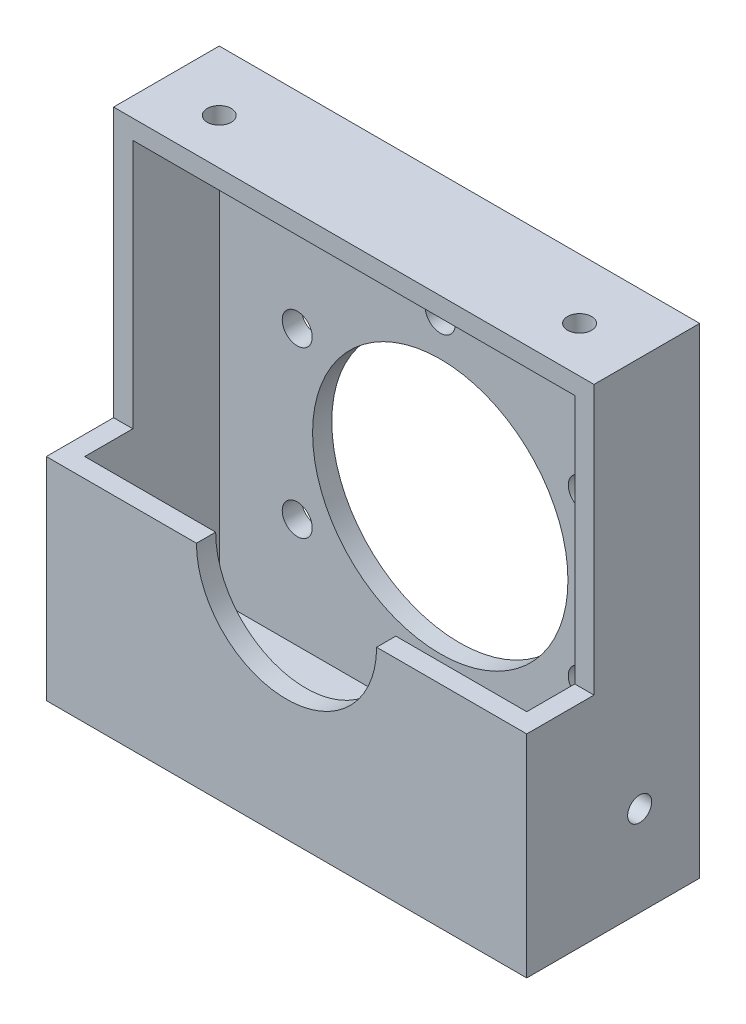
ISO-10303-21;
HEADER;
FILE_DESCRIPTION(('STEP AP214'),'2;1');
FILE_NAME('part.step','',(''),(''),'','','');
FILE_SCHEMA(('AUTOMOTIVE_DESIGN { 1 0 10303 214 1 1 1 1 }'));
ENDSEC;
DATA;
#1=APPLICATION_CONTEXT('core data for automotive mechanical design processes');
#2=APPLICATION_PROTOCOL_DEFINITION('international standard','automotive_design',2000,#1);
#3=PRODUCT_CONTEXT('',#1,'mechanical');
#4=PRODUCT('Part','Part','',(#3));
#5=PRODUCT_RELATED_PRODUCT_CATEGORY('part','',(#4));
#6=PRODUCT_DEFINITION_FORMATION('','',#4);
#7=PRODUCT_DEFINITION_CONTEXT('part definition',#1,'design');
#8=PRODUCT_DEFINITION('design','',#6,#7);
#9=PRODUCT_DEFINITION_SHAPE('','',#8);
#10=(LENGTH_UNIT() NAMED_UNIT(*) SI_UNIT(.MILLI.,.METRE.));
#11=(NAMED_UNIT(*) PLANE_ANGLE_UNIT() SI_UNIT($,.RADIAN.));
#12=(NAMED_UNIT(*) SI_UNIT($,.STERADIAN.) SOLID_ANGLE_UNIT());
#13=UNCERTAINTY_MEASURE_WITH_UNIT(LENGTH_MEASURE(1.E-05),#10,'distance_accuracy_value','');
#14=(GEOMETRIC_REPRESENTATION_CONTEXT(3) GLOBAL_UNCERTAINTY_ASSIGNED_CONTEXT((#13)) GLOBAL_UNIT_ASSIGNED_CONTEXT((#10,
#11,#12)) REPRESENTATION_CONTEXT('',''));
#15=CARTESIAN_POINT('',(0.,0.,0.));
#16=DIRECTION('',(0.,0.,1.));
#17=DIRECTION('',(1.,0.,0.));
#18=AXIS2_PLACEMENT_3D('',#15,#16,#17);
#19=CARTESIAN_POINT('',(0.,22.352,11.176));
#20=DIRECTION('',(0.,1.,0.));
#21=DIRECTION('',(0.,0.,1.));
#22=AXIS2_PLACEMENT_3D('',#19,#20,#21);
#23=PLANE('',#22);
#24=DIRECTION('',(0.,0.,1.));
#25=VECTOR('',#24,1.);
#26=CARTESIAN_POINT('',(15.875,22.352,0.));
#27=LINE('',#26,#25);
#28=CARTESIAN_POINT('',(15.875,22.352,16.256));
#29=VERTEX_POINT('',#28);
#30=CARTESIAN_POINT('',(15.875,22.352,18.288));
#31=VERTEX_POINT('',#30);
#32=EDGE_CURVE('E131',#29,#31,#27,.T.);
#33=ORIENTED_EDGE('',*,*,#32,.F.);
#34=DIRECTION('',(1.,0.,0.));
#35=VECTOR('',#34,1.);
#36=CARTESIAN_POINT('',(0.,22.352,16.256));
#37=LINE('',#36,#35);
#38=CARTESIAN_POINT('',(2.032,22.352,16.256));
#39=VERTEX_POINT('',#38);
#40=EDGE_CURVE('E251',#39,#29,#37,.T.);
#41=ORIENTED_EDGE('',*,*,#40,.F.);
#42=DIRECTION('',(0.,0.,1.));
#43=VECTOR('',#42,1.);
#44=CARTESIAN_POINT('',(2.032,22.352,11.176));
#45=LINE('',#44,#43);
#46=CARTESIAN_POINT('',(2.032,22.352,11.176));
#47=VERTEX_POINT('',#46);
#48=EDGE_CURVE('E256',#47,#39,#45,.T.);
#49=ORIENTED_EDGE('',*,*,#48,.F.);
#50=DIRECTION('',(1.,0.,0.));
#51=VECTOR('',#50,1.);
#52=CARTESIAN_POINT('',(0.,22.352,11.176));
#53=LINE('',#52,#51);
#54=CARTESIAN_POINT('',(0.,22.352,11.176));
#55=VERTEX_POINT('',#54);
#56=EDGE_CURVE('E159',#55,#47,#53,.T.);
#57=ORIENTED_EDGE('',*,*,#56,.F.);
#58=DIRECTION('',(0.,0.,1.));
#59=VECTOR('',#58,1.);
#60=CARTESIAN_POINT('',(0.,22.352,11.176));
#61=LINE('',#60,#59);
#62=CARTESIAN_POINT('',(0.,22.352,18.288));
#63=VERTEX_POINT('',#62);
#64=EDGE_CURVE('E155',#55,#63,#61,.T.);
#65=ORIENTED_EDGE('',*,*,#64,.T.);
#66=DIRECTION('',(1.,0.,0.));
#67=VECTOR('',#66,1.);
#68=CARTESIAN_POINT('',(0.,22.352,18.288));
#69=LINE('',#68,#67);
#70=EDGE_CURVE('E150',#63,#31,#69,.T.);
#71=ORIENTED_EDGE('',*,*,#70,.T.);
#72=EDGE_LOOP('',(#33,#41,#49,#57,#65,#71));
#73=FACE_BOUND('',#72,.T.);
#74=ADVANCED_FACE('F28',(#73),#23,.T.);
#75=CARTESIAN_POINT('',(50.8,50.8,18.288));
#76=DIRECTION('',(0.,-1.,0.));
#77=DIRECTION('',(1.,0.,0.));
#78=AXIS2_PLACEMENT_3D('',#75,#76,#77);
#79=PLANE('',#78);
#80=DIRECTION('',(0.,0.,-1.));
#81=VECTOR('',#80,1.);
#82=CARTESIAN_POINT('',(0.,50.8,18.288));
#83=LINE('',#82,#81);
#84=CARTESIAN_POINT('',(0.,50.8,11.176));
#85=VERTEX_POINT('',#84);
#86=CARTESIAN_POINT('',(0.,50.8,0.));
#87=VERTEX_POINT('',#86);
#88=EDGE_CURVE('E180',#85,#87,#83,.T.);
#89=ORIENTED_EDGE('',*,*,#88,.F.);
#90=DIRECTION('',(1.,0.,0.));
#91=VECTOR('',#90,1.);
#92=CARTESIAN_POINT('',(0.,50.8,11.176));
#93=LINE('',#92,#91);
#94=CARTESIAN_POINT('',(50.8,50.8,11.176));
#95=VERTEX_POINT('',#94);
#96=EDGE_CURVE('E165',#85,#95,#93,.T.);
#97=ORIENTED_EDGE('',*,*,#96,.T.);
#98=DIRECTION('',(0.,0.,-1.));
#99=VECTOR('',#98,1.);
#100=CARTESIAN_POINT('',(50.8,50.8,18.288));
#101=LINE('',#100,#99);
#102=CARTESIAN_POINT('',(50.8,50.8,0.));
#103=VERTEX_POINT('',#102);
#104=EDGE_CURVE('E184',#95,#103,#101,.T.);
#105=ORIENTED_EDGE('',*,*,#104,.T.);
#106=DIRECTION('',(-1.,0.,0.));
#107=VECTOR('',#106,1.);
#108=CARTESIAN_POINT('',(50.8,50.8,0.));
#109=LINE('',#108,#107);
#110=EDGE_CURVE('E164',#103,#87,#109,.T.);
#111=ORIENTED_EDGE('',*,*,#110,.T.);
#112=EDGE_LOOP('',(#89,#97,#105,#111));
#113=FACE_BOUND('',#112,.T.);
#114=CARTESIAN_POINT('',(44.45,50.8,6.34999999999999));
#115=DIRECTION('',(0.,1.,0.));
#116=DIRECTION('',(-1.,0.,0.));
#117=AXIS2_PLACEMENT_3D('',#114,#115,#116);
#118=CIRCLE('',#117,1.27);
#119=CARTESIAN_POINT('',(43.18,50.8,6.34999999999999));
#120=VERTEX_POINT('',#119);
#121=EDGE_CURVE('E211',#120,#120,#118,.T.);
#122=ORIENTED_EDGE('',*,*,#121,.F.);
#123=EDGE_LOOP('',(#122));
#124=FACE_BOUND('',#123,.T.);
#125=CARTESIAN_POINT('',(6.35,50.8,6.35));
#126=DIRECTION('',(0.,-1.,0.));
#127=DIRECTION('',(1.,0.,0.));
#128=AXIS2_PLACEMENT_3D('',#125,#126,#127);
#129=CIRCLE('',#128,1.27);
#130=CARTESIAN_POINT('',(5.08,50.8,6.35));
#131=VERTEX_POINT('',#130);
#132=EDGE_CURVE('E207',#131,#131,#129,.T.);
#133=ORIENTED_EDGE('',*,*,#132,.T.);
#134=EDGE_LOOP('',(#133));
#135=FACE_BOUND('',#134,.T.);
#136=ADVANCED_FACE('F281',(#113,#124,#135),#79,.F.);
#137=CARTESIAN_POINT('',(50.8,48.768,18.288));
#138=DIRECTION('',(0.,-1.,0.));
#139=DIRECTION('',(1.,0.,0.));
#140=AXIS2_PLACEMENT_3D('',#137,#138,#139);
#141=PLANE('',#140);
#142=DIRECTION('',(0.,0.,-1.));
#143=VECTOR('',#142,1.);
#144=CARTESIAN_POINT('',(2.032,48.768,18.288));
#145=LINE('',#144,#143);
#146=CARTESIAN_POINT('',(2.032,48.768,11.176));
#147=VERTEX_POINT('',#146);
#148=CARTESIAN_POINT('',(2.032,48.768,2.032));
#149=VERTEX_POINT('',#148);
#150=EDGE_CURVE('E229',#147,#149,#145,.T.);
#151=ORIENTED_EDGE('',*,*,#150,.T.);
#152=DIRECTION('',(-1.,0.,0.));
#153=VECTOR('',#152,1.);
#154=CARTESIAN_POINT('',(0.,48.768,2.032));
#155=LINE('',#154,#153);
#156=CARTESIAN_POINT('',(48.768,48.768,2.032));
#157=VERTEX_POINT('',#156);
#158=EDGE_CURVE('E236',#157,#149,#155,.T.);
#159=ORIENTED_EDGE('',*,*,#158,.F.);
#160=DIRECTION('',(0.,0.,-1.));
#161=VECTOR('',#160,1.);
#162=CARTESIAN_POINT('',(48.768,48.768,18.288));
#163=LINE('',#162,#161);
#164=CARTESIAN_POINT('',(48.768,48.768,11.176));
#165=VERTEX_POINT('',#164);
#166=EDGE_CURVE('E232',#165,#157,#163,.T.);
#167=ORIENTED_EDGE('',*,*,#166,.F.);
#168=DIRECTION('',(1.,0.,0.));
#169=VECTOR('',#168,1.);
#170=CARTESIAN_POINT('',(50.8,48.768,11.176));
#171=LINE('',#170,#169);
#172=EDGE_CURVE('E237',#147,#165,#171,.T.);
#173=ORIENTED_EDGE('',*,*,#172,.F.);
#174=EDGE_LOOP('',(#151,#159,#167,#173));
#175=FACE_BOUND('',#174,.T.);
#176=CARTESIAN_POINT('',(44.45,48.768,6.34999999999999));
#177=DIRECTION('',(0.,-1.,0.));
#178=DIRECTION('',(1.,0.,0.));
#179=AXIS2_PLACEMENT_3D('',#176,#177,#178);
#180=CIRCLE('',#179,1.27);
#181=CARTESIAN_POINT('',(43.18,48.768,6.34999999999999));
#182=VERTEX_POINT('',#181);
#183=EDGE_CURVE('E210',#182,#182,#180,.F.);
#184=ORIENTED_EDGE('',*,*,#183,.T.);
#185=EDGE_LOOP('',(#184));
#186=FACE_BOUND('',#185,.T.);
#187=CARTESIAN_POINT('',(6.35,48.768,6.35));
#188=DIRECTION('',(0.,-1.,0.));
#189=DIRECTION('',(1.,0.,0.));
#190=AXIS2_PLACEMENT_3D('',#187,#188,#189);
#191=CIRCLE('',#190,1.27);
#192=CARTESIAN_POINT('',(5.08,48.768,6.35));
#193=VERTEX_POINT('',#192);
#194=EDGE_CURVE('E193',#193,#193,#191,.T.);
#195=ORIENTED_EDGE('',*,*,#194,.F.);
#196=EDGE_LOOP('',(#195));
#197=FACE_BOUND('',#196,.T.);
#198=ADVANCED_FACE('F315',(#175,#186,#197),#141,.T.);
#199=CARTESIAN_POINT('',(0.,0.,0.));
#200=DIRECTION('',(0.,0.,-1.));
#201=DIRECTION('',(-1.,0.,0.));
#202=AXIS2_PLACEMENT_3D('',#199,#200,#201);
#203=PLANE('',#202);
#204=CARTESIAN_POINT('',(10.2770313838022,13.6207500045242,0.));
#205=DIRECTION('',(0.,0.,-1.));
#206=DIRECTION('',(-0.50000000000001,-0.866025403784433,0.));
#207=AXIS2_PLACEMENT_3D('',#204,#205,#206);
#208=CIRCLE('',#207,1.58750000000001);
#209=CARTESIAN_POINT('',(9.48328138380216,12.2459346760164,0.));
#210=VERTEX_POINT('',#209);
#211=EDGE_CURVE('E493',#210,#210,#208,.T.);
#212=ORIENTED_EDGE('',*,*,#211,.F.);
#213=EDGE_LOOP('',(#212));
#214=FACE_BOUND('',#213,.T.);
#215=CARTESIAN_POINT('',(25.3999999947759,4.8895,0.));
#216=DIRECTION('',(0.,0.,-1.));
#217=DIRECTION('',(0.499999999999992,-0.866025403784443,0.));
#218=AXIS2_PLACEMENT_3D('',#215,#216,#217);
#219=CIRCLE('',#218,1.58750000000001);
#220=CARTESIAN_POINT('',(26.1937499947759,3.51468467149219,0.));
#221=VERTEX_POINT('',#220);
#222=EDGE_CURVE('E497',#221,#221,#219,.T.);
#223=ORIENTED_EDGE('',*,*,#222,.F.);
#224=EDGE_LOOP('',(#223));
#225=FACE_BOUND('',#224,.T.);
#226=CARTESIAN_POINT('',(40.5229686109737,13.6207499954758,0.));
#227=DIRECTION('',(0.,0.,-1.));
#228=DIRECTION('',(1.,0.,0.));
#229=AXIS2_PLACEMENT_3D('',#226,#227,#228);
#230=CIRCLE('',#229,1.58750000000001);
#231=CARTESIAN_POINT('',(42.1104686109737,13.6207499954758,0.));
#232=VERTEX_POINT('',#231);
#233=EDGE_CURVE('E501',#232,#232,#230,.T.);
#234=ORIENTED_EDGE('',*,*,#233,.F.);
#235=EDGE_LOOP('',(#234));
#236=FACE_BOUND('',#235,.T.);
#237=CARTESIAN_POINT('',(40.5229686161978,31.0832499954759,0.));
#238=DIRECTION('',(0.,0.,-1.));
#239=DIRECTION('',(0.500000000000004,0.866025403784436,0.));
#240=AXIS2_PLACEMENT_3D('',#237,#238,#239);
#241=CIRCLE('',#240,1.58750000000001);
#242=CARTESIAN_POINT('',(41.3167186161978,32.4580653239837,0.));
#243=VERTEX_POINT('',#242);
#244=EDGE_CURVE('E505',#243,#243,#241,.T.);
#245=ORIENTED_EDGE('',*,*,#244,.F.);
#246=EDGE_LOOP('',(#245));
#247=FACE_BOUND('',#246,.T.);
#248=CARTESIAN_POINT('',(25.400000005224,39.8145,0.));
#249=DIRECTION('',(0.,0.,-1.));
#250=DIRECTION('',(-0.499999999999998,0.86602540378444,0.));
#251=AXIS2_PLACEMENT_3D('',#248,#249,#250);
#252=CIRCLE('',#251,1.58750000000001);
#253=CARTESIAN_POINT('',(24.606250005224,41.1893153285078,0.));
#254=VERTEX_POINT('',#253);
#255=EDGE_CURVE('E509',#254,#254,#252,.T.);
#256=ORIENTED_EDGE('',*,*,#255,.F.);
#257=EDGE_LOOP('',(#256));
#258=FACE_BOUND('',#257,.T.);
#259=CARTESIAN_POINT('',(10.2770313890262,31.0832500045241,0.));
#260=DIRECTION('',(0.,0.,-1.));
#261=DIRECTION('',(-1.,0.,0.));
#262=AXIS2_PLACEMENT_3D('',#259,#260,#261);
#263=CIRCLE('',#262,1.58750000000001);
#264=CARTESIAN_POINT('',(8.68953138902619,31.0832500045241,0.));
#265=VERTEX_POINT('',#264);
#266=EDGE_CURVE('E512',#265,#265,#263,.T.);
#267=ORIENTED_EDGE('',*,*,#266,.F.);
#268=EDGE_LOOP('',(#267));
#269=FACE_BOUND('',#268,.T.);
#270=DIRECTION('',(0.,1.,0.));
#271=VECTOR('',#270,1.);
#272=CARTESIAN_POINT('',(0.,0.,0.));
#273=LINE('',#272,#271);
#274=CARTESIAN_POINT('',(0.,0.,0.));
#275=VERTEX_POINT('',#274);
#276=EDGE_CURVE('E161',#275,#87,#273,.T.);
#277=ORIENTED_EDGE('',*,*,#276,.T.);
#278=ORIENTED_EDGE('',*,*,#110,.F.);
#279=DIRECTION('',(0.,-1.,0.));
#280=VECTOR('',#279,1.);
#281=CARTESIAN_POINT('',(50.8,50.8,0.));
#282=LINE('',#281,#280);
#283=CARTESIAN_POINT('',(50.8,0.,0.));
#284=VERTEX_POINT('',#283);
#285=EDGE_CURVE('E168',#103,#284,#282,.T.);
#286=ORIENTED_EDGE('',*,*,#285,.T.);
#287=DIRECTION('',(1.,0.,0.));
#288=VECTOR('',#287,1.);
#289=CARTESIAN_POINT('',(0.,0.,0.));
#290=LINE('',#289,#288);
#291=EDGE_CURVE('E171',#275,#284,#290,.T.);
#292=ORIENTED_EDGE('',*,*,#291,.F.);
#293=EDGE_LOOP('',(#277,#278,#286,#292));
#294=FACE_BOUND('',#293,.T.);
#295=CARTESIAN_POINT('',(25.4,22.352,0.));
#296=DIRECTION('',(0.,0.,1.));
#297=DIRECTION('',(1.,0.,0.));
#298=AXIS2_PLACEMENT_3D('',#295,#296,#297);
#299=CIRCLE('',#298,13.5001);
#300=CARTESIAN_POINT('',(38.9001,22.352,0.));
#301=VERTEX_POINT('',#300);
#302=EDGE_CURVE('E217',#301,#301,#299,.T.);
#303=ORIENTED_EDGE('',*,*,#302,.T.);
#304=EDGE_LOOP('',(#303));
#305=FACE_BOUND('',#304,.T.);
#306=ADVANCED_FACE('F284',(#214,#225,#236,#247,#258,#269,#294,#305),#203,.T.);
#307=CARTESIAN_POINT('',(0.,0.,2.032));
#308=DIRECTION('',(0.,0.,-1.));
#309=DIRECTION('',(-1.,0.,0.));
#310=AXIS2_PLACEMENT_3D('',#307,#308,#309);
#311=PLANE('',#310);
#312=CARTESIAN_POINT('',(10.2770313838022,13.6207500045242,2.032));
#313=DIRECTION('',(0.,0.,-1.));
#314=DIRECTION('',(-1.,0.,0.));
#315=AXIS2_PLACEMENT_3D('',#312,#313,#314);
#316=CIRCLE('',#315,1.58750000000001);
#317=CARTESIAN_POINT('',(8.68953138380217,13.6207500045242,2.032));
#318=VERTEX_POINT('',#317);
#319=EDGE_CURVE('E530',#318,#318,#316,.F.);
#320=ORIENTED_EDGE('',*,*,#319,.F.);
#321=EDGE_LOOP('',(#320));
#322=FACE_BOUND('',#321,.T.);
#323=CARTESIAN_POINT('',(25.3999999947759,4.8895,2.032));
#324=DIRECTION('',(0.,0.,-1.));
#325=DIRECTION('',(-1.,0.,0.));
#326=AXIS2_PLACEMENT_3D('',#323,#324,#325);
#327=CIRCLE('',#326,1.58750000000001);
#328=CARTESIAN_POINT('',(23.8124999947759,4.8895,2.032));
#329=VERTEX_POINT('',#328);
#330=EDGE_CURVE('E526',#329,#329,#327,.F.);
#331=ORIENTED_EDGE('',*,*,#330,.F.);
#332=EDGE_LOOP('',(#331));
#333=FACE_BOUND('',#332,.T.);
#334=CARTESIAN_POINT('',(40.5229686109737,13.6207499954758,2.032));
#335=DIRECTION('',(0.,0.,-1.));
#336=DIRECTION('',(-1.,0.,0.));
#337=AXIS2_PLACEMENT_3D('',#334,#335,#336);
#338=CIRCLE('',#337,1.58750000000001);
#339=CARTESIAN_POINT('',(38.9354686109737,13.6207499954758,2.032));
#340=VERTEX_POINT('',#339);
#341=EDGE_CURVE('E524',#340,#340,#338,.F.);
#342=ORIENTED_EDGE('',*,*,#341,.F.);
#343=EDGE_LOOP('',(#342));
#344=FACE_BOUND('',#343,.T.);
#345=CARTESIAN_POINT('',(40.5229686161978,31.0832499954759,2.032));
#346=DIRECTION('',(0.,0.,-1.));
#347=DIRECTION('',(-1.,0.,0.));
#348=AXIS2_PLACEMENT_3D('',#345,#346,#347);
#349=CIRCLE('',#348,1.58750000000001);
#350=CARTESIAN_POINT('',(38.9354686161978,31.0832499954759,2.032));
#351=VERTEX_POINT('',#350);
#352=EDGE_CURVE('E520',#351,#351,#349,.F.);
#353=ORIENTED_EDGE('',*,*,#352,.F.);
#354=EDGE_LOOP('',(#353));
#355=FACE_BOUND('',#354,.T.);
#356=CARTESIAN_POINT('',(25.400000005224,39.8145,2.032));
#357=DIRECTION('',(0.,0.,-1.));
#358=DIRECTION('',(-1.,0.,0.));
#359=AXIS2_PLACEMENT_3D('',#356,#357,#358);
#360=CIRCLE('',#359,1.58750000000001);
#361=CARTESIAN_POINT('',(23.812500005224,39.8145,2.032));
#362=VERTEX_POINT('',#361);
#363=EDGE_CURVE('E513',#362,#362,#360,.F.);
#364=ORIENTED_EDGE('',*,*,#363,.F.);
#365=EDGE_LOOP('',(#364));
#366=FACE_BOUND('',#365,.T.);
#367=CARTESIAN_POINT('',(10.2770313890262,31.0832500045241,2.032));
#368=DIRECTION('',(0.,0.,-1.));
#369=DIRECTION('',(-1.,0.,0.));
#370=AXIS2_PLACEMENT_3D('',#367,#368,#369);
#371=CIRCLE('',#370,1.58750000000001);
#372=CARTESIAN_POINT('',(8.68953138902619,31.0832500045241,2.032));
#373=VERTEX_POINT('',#372);
#374=EDGE_CURVE('E201',#373,#373,#371,.F.);
#375=ORIENTED_EDGE('',*,*,#374,.F.);
#376=EDGE_LOOP('',(#375));
#377=FACE_BOUND('',#376,.T.);
#378=DIRECTION('',(0.,1.,0.));
#379=VECTOR('',#378,1.);
#380=CARTESIAN_POINT('',(2.032,0.,2.032));
#381=LINE('',#380,#379);
#382=CARTESIAN_POINT('',(2.032,2.032,2.032));
#383=VERTEX_POINT('',#382);
#384=EDGE_CURVE('E233',#383,#149,#381,.T.);
#385=ORIENTED_EDGE('',*,*,#384,.F.);
#386=DIRECTION('',(1.,0.,0.));
#387=VECTOR('',#386,1.);
#388=CARTESIAN_POINT('',(0.,2.032,2.032));
#389=LINE('',#388,#387);
#390=CARTESIAN_POINT('',(48.768,2.03200000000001,2.032));
#391=VERTEX_POINT('',#390);
#392=EDGE_CURVE('E225',#383,#391,#389,.T.);
#393=ORIENTED_EDGE('',*,*,#392,.T.);
#394=DIRECTION('',(0.,-1.,0.));
#395=VECTOR('',#394,1.);
#396=CARTESIAN_POINT('',(48.768,0.,2.032));
#397=LINE('',#396,#395);
#398=EDGE_CURVE('E244',#157,#391,#397,.T.);
#399=ORIENTED_EDGE('',*,*,#398,.F.);
#400=ORIENTED_EDGE('',*,*,#158,.T.);
#401=EDGE_LOOP('',(#385,#393,#399,#400));
#402=FACE_BOUND('',#401,.T.);
#403=CARTESIAN_POINT('',(25.4,22.352,2.032));
#404=DIRECTION('',(0.,0.,-1.));
#405=DIRECTION('',(-1.,0.,0.));
#406=AXIS2_PLACEMENT_3D('',#403,#404,#405);
#407=CIRCLE('',#406,13.5001);
#408=CARTESIAN_POINT('',(11.8999,22.352,2.032));
#409=VERTEX_POINT('',#408);
#410=EDGE_CURVE('E214',#409,#409,#407,.T.);
#411=ORIENTED_EDGE('',*,*,#410,.T.);
#412=EDGE_LOOP('',(#411));
#413=FACE_BOUND('',#412,.T.);
#414=ADVANCED_FACE('F321',(#322,#333,#344,#355,#366,#377,#402,#413),#311,.F.);
#415=CARTESIAN_POINT('',(0.,22.352,11.176));
#416=DIRECTION('',(0.,0.,-1.));
#417=DIRECTION('',(-1.,0.,0.));
#418=AXIS2_PLACEMENT_3D('',#415,#416,#417);
#419=PLANE('',#418);
#420=DIRECTION('',(0.,1.,0.));
#421=VECTOR('',#420,1.);
#422=CARTESIAN_POINT('',(48.768,50.8,11.176));
#423=LINE('',#422,#421);
#424=CARTESIAN_POINT('',(48.768,22.352,11.176));
#425=VERTEX_POINT('',#424);
#426=EDGE_CURVE('E254',#425,#165,#423,.T.);
#427=ORIENTED_EDGE('',*,*,#426,.F.);
#428=CARTESIAN_POINT('',(50.8,22.352,11.176));
#429=VERTEX_POINT('',#428);
#430=EDGE_CURVE('E153',#425,#429,#53,.T.);
#431=ORIENTED_EDGE('',*,*,#430,.T.);
#432=DIRECTION('',(0.,1.,0.));
#433=VECTOR('',#432,1.);
#434=CARTESIAN_POINT('',(50.8,22.352,11.176));
#435=LINE('',#434,#433);
#436=EDGE_CURVE('E264',#429,#95,#435,.T.);
#437=ORIENTED_EDGE('',*,*,#436,.T.);
#438=ORIENTED_EDGE('',*,*,#96,.F.);
#439=DIRECTION('',(0.,1.,0.));
#440=VECTOR('',#439,1.);
#441=CARTESIAN_POINT('',(0.,22.352,11.176));
#442=LINE('',#441,#440);
#443=EDGE_CURVE('E151',#55,#85,#442,.T.);
#444=ORIENTED_EDGE('',*,*,#443,.F.);
#445=ORIENTED_EDGE('',*,*,#56,.T.);
#446=DIRECTION('',(0.,1.,0.));
#447=VECTOR('',#446,1.);
#448=CARTESIAN_POINT('',(2.032,22.352,11.176));
#449=LINE('',#448,#447);
#450=EDGE_CURVE('E259',#47,#147,#449,.T.);
#451=ORIENTED_EDGE('',*,*,#450,.T.);
#452=ORIENTED_EDGE('',*,*,#172,.T.);
#453=EDGE_LOOP('',(#427,#431,#437,#438,#444,#445,#451,#452));
#454=FACE_BOUND('',#453,.T.);
#455=ADVANCED_FACE('F275',(#454),#419,.F.);
#456=DIRECTION('',(0.,0.,1.));
#457=VECTOR('',#456,1.);
#458=CARTESIAN_POINT('',(34.925,22.352,0.));
#459=LINE('',#458,#457);
#460=CARTESIAN_POINT('',(34.925,22.352,18.288));
#461=VERTEX_POINT('',#460);
#462=CARTESIAN_POINT('',(34.925,22.352,16.256));
#463=VERTEX_POINT('',#462);
#464=EDGE_CURVE('E42',#461,#463,#459,.F.);
#465=ORIENTED_EDGE('',*,*,#464,.F.);
#466=CARTESIAN_POINT('',(50.8,22.352,18.288));
#467=VERTEX_POINT('',#466);
#468=EDGE_CURVE('E141',#461,#467,#69,.T.);
#469=ORIENTED_EDGE('',*,*,#468,.T.);
#470=DIRECTION('',(0.,0.,1.));
#471=VECTOR('',#470,1.);
#472=CARTESIAN_POINT('',(50.8,22.352,11.176));
#473=LINE('',#472,#471);
#474=EDGE_CURVE('E240',#429,#467,#473,.T.);
#475=ORIENTED_EDGE('',*,*,#474,.F.);
#476=ORIENTED_EDGE('',*,*,#430,.F.);
#477=DIRECTION('',(0.,0.,1.));
#478=VECTOR('',#477,1.);
#479=CARTESIAN_POINT('',(48.768,22.352,18.288));
#480=LINE('',#479,#478);
#481=CARTESIAN_POINT('',(48.768,22.352,16.256));
#482=VERTEX_POINT('',#481);
#483=EDGE_CURVE('E220',#425,#482,#480,.T.);
#484=ORIENTED_EDGE('',*,*,#483,.T.);
#485=EDGE_CURVE('E144',#463,#482,#37,.T.);
#486=ORIENTED_EDGE('',*,*,#485,.F.);
#487=EDGE_LOOP('',(#465,#469,#475,#476,#484,#486));
#488=FACE_BOUND('',#487,.T.);
#489=ADVANCED_FACE('F139',(#488),#23,.T.);
#490=CARTESIAN_POINT('',(0.,0.,18.288));
#491=DIRECTION('',(0.,0.,-1.));
#492=DIRECTION('',(-1.,0.,0.));
#493=AXIS2_PLACEMENT_3D('',#490,#491,#492);
#494=PLANE('',#493);
#495=ORIENTED_EDGE('',*,*,#468,.F.);
#496=CARTESIAN_POINT('',(25.4,22.352,18.288));
#497=DIRECTION('',(0.,0.,1.));
#498=DIRECTION('',(1.,0.,0.));
#499=AXIS2_PLACEMENT_3D('',#496,#497,#498);
#500=CIRCLE('',#499,9.525);
#501=EDGE_CURVE('E128',#31,#461,#500,.T.);
#502=ORIENTED_EDGE('',*,*,#501,.F.);
#503=ORIENTED_EDGE('',*,*,#70,.F.);
#504=DIRECTION('',(0.,1.,0.));
#505=VECTOR('',#504,1.);
#506=CARTESIAN_POINT('',(0.,0.,18.288));
#507=LINE('',#506,#505);
#508=CARTESIAN_POINT('',(0.,0.,18.288));
#509=VERTEX_POINT('',#508);
#510=EDGE_CURVE('E174',#509,#63,#507,.T.);
#511=ORIENTED_EDGE('',*,*,#510,.F.);
#512=DIRECTION('',(1.,0.,0.));
#513=VECTOR('',#512,1.);
#514=CARTESIAN_POINT('',(0.,0.,18.288));
#515=LINE('',#514,#513);
#516=CARTESIAN_POINT('',(50.8,0.,18.288));
#517=VERTEX_POINT('',#516);
#518=EDGE_CURVE('E178',#509,#517,#515,.T.);
#519=ORIENTED_EDGE('',*,*,#518,.T.);
#520=DIRECTION('',(0.,-1.,0.));
#521=VECTOR('',#520,1.);
#522=CARTESIAN_POINT('',(50.8,50.8,18.288));
#523=LINE('',#522,#521);
#524=EDGE_CURVE('E149',#467,#517,#523,.T.);
#525=ORIENTED_EDGE('',*,*,#524,.F.);
#526=EDGE_LOOP('',(#495,#502,#503,#511,#519,#525));
#527=FACE_BOUND('',#526,.T.);
#528=ADVANCED_FACE('F147',(#527),#494,.F.);
#529=CARTESIAN_POINT('',(0.,0.,18.288));
#530=DIRECTION('',(-1.,0.,0.));
#531=DIRECTION('',(0.,0.,1.));
#532=AXIS2_PLACEMENT_3D('',#529,#530,#531);
#533=PLANE('',#532);
#534=CARTESIAN_POINT('',(0.,9.525,6.34999999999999));
#535=DIRECTION('',(1.,0.,0.));
#536=DIRECTION('',(0.,1.,0.));
#537=AXIS2_PLACEMENT_3D('',#534,#535,#536);
#538=CIRCLE('',#537,1.27);
#539=CARTESIAN_POINT('',(0.,10.795,6.34999999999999));
#540=VERTEX_POINT('',#539);
#541=EDGE_CURVE('E189',#540,#540,#538,.T.);
#542=ORIENTED_EDGE('',*,*,#541,.T.);
#543=EDGE_LOOP('',(#542));
#544=FACE_BOUND('',#543,.T.);
#545=ORIENTED_EDGE('',*,*,#443,.T.);
#546=ORIENTED_EDGE('',*,*,#88,.T.);
#547=ORIENTED_EDGE('',*,*,#276,.F.);
#548=DIRECTION('',(0.,0.,-1.));
#549=VECTOR('',#548,1.);
#550=CARTESIAN_POINT('',(0.,0.,18.288));
#551=LINE('',#550,#549);
#552=EDGE_CURVE('E36',#509,#275,#551,.T.);
#553=ORIENTED_EDGE('',*,*,#552,.F.);
#554=ORIENTED_EDGE('',*,*,#510,.T.);
#555=ORIENTED_EDGE('',*,*,#64,.F.);
#556=EDGE_LOOP('',(#545,#546,#547,#553,#554,#555));
#557=FACE_BOUND('',#556,.T.);
#558=ADVANCED_FACE('F30',(#544,#557),#533,.T.);
#559=CARTESIAN_POINT('',(0.,0.,18.288));
#560=DIRECTION('',(0.,1.,0.));
#561=DIRECTION('',(-1.,0.,0.));
#562=AXIS2_PLACEMENT_3D('',#559,#560,#561);
#563=PLANE('',#562);
#564=ORIENTED_EDGE('',*,*,#291,.T.);
#565=DIRECTION('',(0.,0.,-1.));
#566=VECTOR('',#565,1.);
#567=CARTESIAN_POINT('',(50.8,0.,18.288));
#568=LINE('',#567,#566);
#569=EDGE_CURVE('E182',#517,#284,#568,.T.);
#570=ORIENTED_EDGE('',*,*,#569,.F.);
#571=ORIENTED_EDGE('',*,*,#518,.F.);
#572=ORIENTED_EDGE('',*,*,#552,.T.);
#573=EDGE_LOOP('',(#564,#570,#571,#572));
#574=FACE_BOUND('',#573,.T.);
#575=ADVANCED_FACE('F296',(#574),#563,.F.);
#576=CARTESIAN_POINT('',(50.8,50.8,18.288));
#577=DIRECTION('',(1.,0.,0.));
#578=DIRECTION('',(0.,1.,0.));
#579=AXIS2_PLACEMENT_3D('',#576,#577,#578);
#580=PLANE('',#579);
#581=CARTESIAN_POINT('',(50.8,9.525,6.34999999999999));
#582=DIRECTION('',(1.,0.,0.));
#583=DIRECTION('',(0.,1.,0.));
#584=AXIS2_PLACEMENT_3D('',#581,#582,#583);
#585=CIRCLE('',#584,1.27);
#586=CARTESIAN_POINT('',(50.8,10.795,6.34999999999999));
#587=VERTEX_POINT('',#586);
#588=EDGE_CURVE('E196',#587,#587,#585,.T.);
#589=ORIENTED_EDGE('',*,*,#588,.F.);
#590=EDGE_LOOP('',(#589));
#591=FACE_BOUND('',#590,.T.);
#592=ORIENTED_EDGE('',*,*,#436,.F.);
#593=ORIENTED_EDGE('',*,*,#474,.T.);
#594=ORIENTED_EDGE('',*,*,#524,.T.);
#595=ORIENTED_EDGE('',*,*,#569,.T.);
#596=ORIENTED_EDGE('',*,*,#285,.F.);
#597=ORIENTED_EDGE('',*,*,#104,.F.);
#598=EDGE_LOOP('',(#592,#593,#594,#595,#596,#597));
#599=FACE_BOUND('',#598,.T.);
#600=ADVANCED_FACE('F278',(#591,#599),#580,.T.);
#601=CARTESIAN_POINT('',(0.,0.,16.256));
#602=DIRECTION('',(0.,0.,-1.));
#603=DIRECTION('',(-1.,0.,0.));
#604=AXIS2_PLACEMENT_3D('',#601,#602,#603);
#605=PLANE('',#604);
#606=CARTESIAN_POINT('',(25.4,22.352,16.256));
#607=DIRECTION('',(0.,0.,-1.));
#608=DIRECTION('',(-1.,0.,0.));
#609=AXIS2_PLACEMENT_3D('',#606,#607,#608);
#610=CIRCLE('',#609,9.525);
#611=EDGE_CURVE('E11',#463,#29,#610,.T.);
#612=ORIENTED_EDGE('',*,*,#611,.F.);
#613=ORIENTED_EDGE('',*,*,#485,.T.);
#614=DIRECTION('',(0.,-1.,0.));
#615=VECTOR('',#614,1.);
#616=CARTESIAN_POINT('',(48.768,0.,16.256));
#617=LINE('',#616,#615);
#618=CARTESIAN_POINT('',(48.768,2.03200000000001,16.256));
#619=VERTEX_POINT('',#618);
#620=EDGE_CURVE('E224',#482,#619,#617,.T.);
#621=ORIENTED_EDGE('',*,*,#620,.T.);
#622=DIRECTION('',(1.,0.,0.));
#623=VECTOR('',#622,1.);
#624=CARTESIAN_POINT('',(0.,2.032,16.256));
#625=LINE('',#624,#623);
#626=CARTESIAN_POINT('',(2.032,2.032,16.256));
#627=VERTEX_POINT('',#626);
#628=EDGE_CURVE('E226',#627,#619,#625,.T.);
#629=ORIENTED_EDGE('',*,*,#628,.F.);
#630=DIRECTION('',(0.,1.,0.));
#631=VECTOR('',#630,1.);
#632=CARTESIAN_POINT('',(2.032,0.,16.256));
#633=LINE('',#632,#631);
#634=EDGE_CURVE('E50',#627,#39,#633,.T.);
#635=ORIENTED_EDGE('',*,*,#634,.T.);
#636=ORIENTED_EDGE('',*,*,#40,.T.);
#637=EDGE_LOOP('',(#612,#613,#621,#629,#635,#636));
#638=FACE_BOUND('',#637,.T.);
#639=ADVANCED_FACE('F303',(#638),#605,.T.);
#640=CARTESIAN_POINT('',(2.032,0.,18.288));
#641=DIRECTION('',(-1.,0.,0.));
#642=DIRECTION('',(0.,0.,1.));
#643=AXIS2_PLACEMENT_3D('',#640,#641,#642);
#644=PLANE('',#643);
#645=CARTESIAN_POINT('',(2.032,9.525,6.34999999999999));
#646=DIRECTION('',(-1.,0.,0.));
#647=DIRECTION('',(0.,0.,1.));
#648=AXIS2_PLACEMENT_3D('',#645,#646,#647);
#649=CIRCLE('',#648,1.27);
#650=CARTESIAN_POINT('',(2.032,9.525,7.61999999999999));
#651=VERTEX_POINT('',#650);
#652=EDGE_CURVE('E188',#651,#651,#649,.T.);
#653=ORIENTED_EDGE('',*,*,#652,.T.);
#654=EDGE_LOOP('',(#653));
#655=FACE_BOUND('',#654,.T.);
#656=ORIENTED_EDGE('',*,*,#450,.F.);
#657=ORIENTED_EDGE('',*,*,#48,.T.);
#658=ORIENTED_EDGE('',*,*,#634,.F.);
#659=DIRECTION('',(0.,0.,-1.));
#660=VECTOR('',#659,1.);
#661=CARTESIAN_POINT('',(2.032,2.032,18.288));
#662=LINE('',#661,#660);
#663=EDGE_CURVE('E238',#627,#383,#662,.T.);
#664=ORIENTED_EDGE('',*,*,#663,.T.);
#665=ORIENTED_EDGE('',*,*,#384,.T.);
#666=ORIENTED_EDGE('',*,*,#150,.F.);
#667=EDGE_LOOP('',(#656,#657,#658,#664,#665,#666));
#668=FACE_BOUND('',#667,.T.);
#669=ADVANCED_FACE('F338',(#655,#668),#644,.F.);
#670=CARTESIAN_POINT('',(0.,2.032,18.288));
#671=DIRECTION('',(0.,1.,0.));
#672=DIRECTION('',(-1.,0.,0.));
#673=AXIS2_PLACEMENT_3D('',#670,#671,#672);
#674=PLANE('',#673);
#675=ORIENTED_EDGE('',*,*,#392,.F.);
#676=ORIENTED_EDGE('',*,*,#663,.F.);
#677=ORIENTED_EDGE('',*,*,#628,.T.);
#678=DIRECTION('',(0.,0.,-1.));
#679=VECTOR('',#678,1.);
#680=CARTESIAN_POINT('',(48.768,2.03200000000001,18.288));
#681=LINE('',#680,#679);
#682=EDGE_CURVE('E241',#619,#391,#681,.T.);
#683=ORIENTED_EDGE('',*,*,#682,.T.);
#684=EDGE_LOOP('',(#675,#676,#677,#683));
#685=FACE_BOUND('',#684,.T.);
#686=ADVANCED_FACE('F336',(#685),#674,.T.);
#687=CARTESIAN_POINT('',(48.768,50.8,18.288));
#688=DIRECTION('',(1.,0.,0.));
#689=DIRECTION('',(0.,1.,0.));
#690=AXIS2_PLACEMENT_3D('',#687,#688,#689);
#691=PLANE('',#690);
#692=CARTESIAN_POINT('',(48.768,9.525,6.34999999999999));
#693=DIRECTION('',(1.,0.,0.));
#694=DIRECTION('',(0.,1.,0.));
#695=AXIS2_PLACEMENT_3D('',#692,#693,#694);
#696=CIRCLE('',#695,1.27);
#697=CARTESIAN_POINT('',(48.768,10.795,6.34999999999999));
#698=VERTEX_POINT('',#697);
#699=EDGE_CURVE('E186',#698,#698,#696,.T.);
#700=ORIENTED_EDGE('',*,*,#699,.T.);
#701=EDGE_LOOP('',(#700));
#702=FACE_BOUND('',#701,.T.);
#703=ORIENTED_EDGE('',*,*,#426,.T.);
#704=ORIENTED_EDGE('',*,*,#166,.T.);
#705=ORIENTED_EDGE('',*,*,#398,.T.);
#706=ORIENTED_EDGE('',*,*,#682,.F.);
#707=ORIENTED_EDGE('',*,*,#620,.F.);
#708=ORIENTED_EDGE('',*,*,#483,.F.);
#709=EDGE_LOOP('',(#703,#704,#705,#706,#707,#708));
#710=FACE_BOUND('',#709,.T.);
#711=ADVANCED_FACE('F332',(#702,#710),#691,.F.);
#712=CARTESIAN_POINT('',(25.4,22.352,18.289));
#713=DIRECTION('',(0.,0.,-1.));
#714=DIRECTION('',(-1.,0.,0.));
#715=AXIS2_PLACEMENT_3D('',#712,#713,#714);
#716=CYLINDRICAL_SURFACE('',#715,13.5001);
#717=ORIENTED_EDGE('',*,*,#302,.F.);
#718=EDGE_LOOP('',(#717));
#719=FACE_BOUND('',#718,.T.);
#720=ORIENTED_EDGE('',*,*,#410,.F.);
#721=EDGE_LOOP('',(#720));
#722=FACE_BOUND('',#721,.T.);
#723=ADVANCED_FACE('F335',(#719,#722),#716,.F.);
#724=CARTESIAN_POINT('',(44.45,-0.00100000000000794,6.34999999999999));
#725=DIRECTION('',(0.,1.,0.));
#726=DIRECTION('',(-1.,0.,0.));
#727=AXIS2_PLACEMENT_3D('',#724,#725,#726);
#728=CYLINDRICAL_SURFACE('',#727,1.27);
#729=CARTESIAN_POINT('',(43.18,48.768,6.34999999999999));
#730=CARTESIAN_POINT('',(43.18,48.7891666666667,6.34999999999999));
#731=CARTESIAN_POINT('',(43.18,48.8103333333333,6.34999999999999));
#732=CARTESIAN_POINT('',(43.18,48.8526666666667,6.34999999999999));
#733=CARTESIAN_POINT('',(43.18,48.8738333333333,6.34999999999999));
#734=CARTESIAN_POINT('',(43.18,48.9161666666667,6.34999999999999));
#735=CARTESIAN_POINT('',(43.18,48.9373333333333,6.34999999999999));
#736=CARTESIAN_POINT('',(43.18,48.9796666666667,6.34999999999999));
#737=CARTESIAN_POINT('',(43.18,49.0008333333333,6.34999999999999));
#738=CARTESIAN_POINT('',(43.18,49.0431666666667,6.34999999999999));
#739=CARTESIAN_POINT('',(43.18,49.0643333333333,6.34999999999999));
#740=CARTESIAN_POINT('',(43.18,49.1066666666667,6.34999999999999));
#741=CARTESIAN_POINT('',(43.18,49.1278333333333,6.34999999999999));
#742=CARTESIAN_POINT('',(43.18,49.1701666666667,6.34999999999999));
#743=CARTESIAN_POINT('',(43.18,49.1913333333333,6.34999999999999));
#744=CARTESIAN_POINT('',(43.18,49.2336666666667,6.34999999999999));
#745=CARTESIAN_POINT('',(43.18,49.2548333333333,6.34999999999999));
#746=CARTESIAN_POINT('',(43.18,49.2971666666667,6.34999999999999));
#747=CARTESIAN_POINT('',(43.18,49.3183333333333,6.34999999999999));
#748=CARTESIAN_POINT('',(43.18,49.3606666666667,6.34999999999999));
#749=CARTESIAN_POINT('',(43.18,49.3818333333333,6.34999999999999));
#750=CARTESIAN_POINT('',(43.18,49.4241666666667,6.34999999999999));
#751=CARTESIAN_POINT('',(43.18,49.4453333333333,6.34999999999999));
#752=CARTESIAN_POINT('',(43.18,49.4876666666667,6.34999999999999));
#753=CARTESIAN_POINT('',(43.18,49.5088333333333,6.34999999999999));
#754=CARTESIAN_POINT('',(43.18,49.5511666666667,6.34999999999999));
#755=CARTESIAN_POINT('',(43.18,49.5723333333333,6.34999999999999));
#756=CARTESIAN_POINT('',(43.18,49.6146666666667,6.34999999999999));
#757=CARTESIAN_POINT('',(43.18,49.6358333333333,6.34999999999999));
#758=CARTESIAN_POINT('',(43.18,49.6781666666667,6.34999999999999));
#759=CARTESIAN_POINT('',(43.18,49.6993333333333,6.34999999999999));
#760=CARTESIAN_POINT('',(43.18,49.7416666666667,6.34999999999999));
#761=CARTESIAN_POINT('',(43.18,49.7628333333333,6.34999999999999));
#762=CARTESIAN_POINT('',(43.18,49.8051666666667,6.34999999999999));
#763=CARTESIAN_POINT('',(43.18,49.8263333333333,6.34999999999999));
#764=CARTESIAN_POINT('',(43.18,49.8686666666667,6.34999999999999));
#765=CARTESIAN_POINT('',(43.18,49.8898333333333,6.34999999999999));
#766=CARTESIAN_POINT('',(43.18,49.9321666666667,6.34999999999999));
#767=CARTESIAN_POINT('',(43.18,49.9533333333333,6.34999999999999));
#768=CARTESIAN_POINT('',(43.18,49.9956666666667,6.34999999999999));
#769=CARTESIAN_POINT('',(43.18,50.0168333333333,6.34999999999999));
#770=CARTESIAN_POINT('',(43.18,50.0591666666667,6.34999999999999));
#771=CARTESIAN_POINT('',(43.18,50.0803333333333,6.34999999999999));
#772=CARTESIAN_POINT('',(43.18,50.1226666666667,6.34999999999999));
#773=CARTESIAN_POINT('',(43.18,50.1438333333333,6.34999999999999));
#774=CARTESIAN_POINT('',(43.18,50.1861666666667,6.34999999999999));
#775=CARTESIAN_POINT('',(43.18,50.2073333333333,6.34999999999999));
#776=CARTESIAN_POINT('',(43.18,50.2496666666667,6.34999999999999));
#777=CARTESIAN_POINT('',(43.18,50.2708333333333,6.34999999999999));
#778=CARTESIAN_POINT('',(43.18,50.3131666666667,6.34999999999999));
#779=CARTESIAN_POINT('',(43.18,50.3343333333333,6.34999999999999));
#780=CARTESIAN_POINT('',(43.18,50.3766666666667,6.34999999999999));
#781=CARTESIAN_POINT('',(43.18,50.3978333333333,6.34999999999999));
#782=CARTESIAN_POINT('',(43.18,50.4401666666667,6.34999999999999));
#783=CARTESIAN_POINT('',(43.18,50.4613333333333,6.34999999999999));
#784=CARTESIAN_POINT('',(43.18,50.5036666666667,6.34999999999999));
#785=CARTESIAN_POINT('',(43.18,50.5248333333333,6.34999999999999));
#786=CARTESIAN_POINT('',(43.18,50.5671666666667,6.34999999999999));
#787=CARTESIAN_POINT('',(43.18,50.5883333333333,6.34999999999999));
#788=CARTESIAN_POINT('',(43.18,50.6306666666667,6.34999999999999));
#789=CARTESIAN_POINT('',(43.18,50.6518333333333,6.34999999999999));
#790=CARTESIAN_POINT('',(43.18,50.6941666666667,6.34999999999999));
#791=CARTESIAN_POINT('',(43.18,50.7153333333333,6.34999999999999));
#792=CARTESIAN_POINT('',(43.18,50.7576666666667,6.34999999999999));
#793=CARTESIAN_POINT('',(43.18,50.7788333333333,6.34999999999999));
#794=CARTESIAN_POINT('',(43.18,50.8,6.34999999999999));
#795=B_SPLINE_CURVE_WITH_KNOTS('',3,(#729,#730,#731,#732,#733,#734,#735,#736,#737,#738,#739,
#740,#741,#742,#743,#744,#745,#746,#747,#748,#749,#750,#751,#752,#753,#754,#755,#756,#757,#758,
#759,#760,#761,#762,#763,#764,#765,#766,#767,#768,#769,#770,#771,#772,#773,#774,#775,#776,#777,
#778,#779,#780,#781,#782,#783,#784,#785,#786,#787,#788,#789,#790,#791,#792,#793,#794),
.UNSPECIFIED.,.F.,.F.,(4,2,2,2,2,2,2,2,2,2,2,2,2,2,2,2,2,2,2,2,2,2,2,2,2,2,2,2,2,2,2,2,4),(0.,
0.0635000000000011,0.127000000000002,0.190500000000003,0.254000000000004,0.317499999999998,
0.380999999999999,0.4445,0.508000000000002,0.571500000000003,0.635000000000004,
0.698500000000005,0.761999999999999,0.8255,0.889000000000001,0.952500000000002,1.016,1.0795,
1.14300000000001,1.20650000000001,1.27000000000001,1.3335,1.397,1.4605,1.524,1.58750000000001,
1.65100000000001,1.71450000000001,1.778,1.8415,1.905,1.96850000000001,2.03200000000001),.UNSPECIFIED.);
#796=EDGE_CURVE('BSEAM347',#182,#120,#795,.T.);
#797=ORIENTED_EDGE('',*,*,#183,.F.);
#798=ORIENTED_EDGE('',*,*,#121,.T.);
#799=ORIENTED_EDGE('',*,*,#796,.T.);
#800=ORIENTED_EDGE('',*,*,#796,.F.);
#801=EDGE_LOOP('',(#797,#799,#798,#800));
#802=FACE_BOUND('',#801,.T.);
#803=ADVANCED_FACE('F347',(#802),#728,.F.);
#804=CARTESIAN_POINT('',(6.34999999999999,-0.001000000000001,6.35));
#805=DIRECTION('',(0.,1.,0.));
#806=DIRECTION('',(-1.,0.,0.));
#807=AXIS2_PLACEMENT_3D('',#804,#805,#806);
#808=CYLINDRICAL_SURFACE('',#807,1.27);
#809=CARTESIAN_POINT('',(5.08,48.768,6.35));
#810=CARTESIAN_POINT('',(5.08,48.7891666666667,6.35));
#811=CARTESIAN_POINT('',(5.08,48.8103333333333,6.35));
#812=CARTESIAN_POINT('',(5.08,48.8526666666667,6.35));
#813=CARTESIAN_POINT('',(5.08,48.8738333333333,6.35));
#814=CARTESIAN_POINT('',(5.08,48.9161666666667,6.35));
#815=CARTESIAN_POINT('',(5.08,48.9373333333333,6.35));
#816=CARTESIAN_POINT('',(5.08,48.9796666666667,6.35));
#817=CARTESIAN_POINT('',(5.08,49.0008333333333,6.35));
#818=CARTESIAN_POINT('',(5.08,49.0431666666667,6.35));
#819=CARTESIAN_POINT('',(5.08,49.0643333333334,6.35));
#820=CARTESIAN_POINT('',(5.08,49.1066666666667,6.35));
#821=CARTESIAN_POINT('',(5.08,49.1278333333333,6.35));
#822=CARTESIAN_POINT('',(5.08,49.1701666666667,6.35));
#823=CARTESIAN_POINT('',(5.08,49.1913333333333,6.35));
#824=CARTESIAN_POINT('',(5.08,49.2336666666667,6.35));
#825=CARTESIAN_POINT('',(5.08,49.2548333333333,6.35));
#826=CARTESIAN_POINT('',(5.08,49.2971666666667,6.35));
#827=CARTESIAN_POINT('',(5.08,49.3183333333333,6.35));
#828=CARTESIAN_POINT('',(5.08,49.3606666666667,6.35));
#829=CARTESIAN_POINT('',(5.08,49.3818333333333,6.35));
#830=CARTESIAN_POINT('',(5.08,49.4241666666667,6.35));
#831=CARTESIAN_POINT('',(5.08,49.4453333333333,6.35));
#832=CARTESIAN_POINT('',(5.08,49.4876666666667,6.35));
#833=CARTESIAN_POINT('',(5.08,49.5088333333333,6.35));
#834=CARTESIAN_POINT('',(5.08,49.5511666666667,6.35));
#835=CARTESIAN_POINT('',(5.08,49.5723333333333,6.35));
#836=CARTESIAN_POINT('',(5.08,49.6146666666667,6.35));
#837=CARTESIAN_POINT('',(5.08,49.6358333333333,6.35));
#838=CARTESIAN_POINT('',(5.08,49.6781666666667,6.35));
#839=CARTESIAN_POINT('',(5.08,49.6993333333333,6.35));
#840=CARTESIAN_POINT('',(5.08,49.7416666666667,6.35));
#841=CARTESIAN_POINT('',(5.08,49.7628333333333,6.35));
#842=CARTESIAN_POINT('',(5.08,49.8051666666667,6.35));
#843=CARTESIAN_POINT('',(5.08,49.8263333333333,6.35));
#844=CARTESIAN_POINT('',(5.08,49.8686666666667,6.35));
#845=CARTESIAN_POINT('',(5.08,49.8898333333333,6.35));
#846=CARTESIAN_POINT('',(5.08,49.9321666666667,6.35));
#847=CARTESIAN_POINT('',(5.08,49.9533333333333,6.35));
#848=CARTESIAN_POINT('',(5.08,49.9956666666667,6.35));
#849=CARTESIAN_POINT('',(5.08,50.0168333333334,6.35));
#850=CARTESIAN_POINT('',(5.08,50.0591666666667,6.35));
#851=CARTESIAN_POINT('',(5.08,50.0803333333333,6.35));
#852=CARTESIAN_POINT('',(5.08,50.1226666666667,6.35));
#853=CARTESIAN_POINT('',(5.08,50.1438333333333,6.35));
#854=CARTESIAN_POINT('',(5.08,50.1861666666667,6.35));
#855=CARTESIAN_POINT('',(5.08,50.2073333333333,6.35));
#856=CARTESIAN_POINT('',(5.08,50.2496666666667,6.35));
#857=CARTESIAN_POINT('',(5.08,50.2708333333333,6.35));
#858=CARTESIAN_POINT('',(5.08,50.3131666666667,6.35));
#859=CARTESIAN_POINT('',(5.08,50.3343333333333,6.35));
#860=CARTESIAN_POINT('',(5.08,50.3766666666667,6.35));
#861=CARTESIAN_POINT('',(5.08,50.3978333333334,6.35));
#862=CARTESIAN_POINT('',(5.08,50.4401666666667,6.35));
#863=CARTESIAN_POINT('',(5.08,50.4613333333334,6.35));
#864=CARTESIAN_POINT('',(5.08,50.5036666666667,6.35));
#865=CARTESIAN_POINT('',(5.08,50.5248333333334,6.35));
#866=CARTESIAN_POINT('',(5.08,50.5671666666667,6.35));
#867=CARTESIAN_POINT('',(5.08,50.5883333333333,6.35));
#868=CARTESIAN_POINT('',(5.08,50.6306666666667,6.35));
#869=CARTESIAN_POINT('',(5.08,50.6518333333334,6.35));
#870=CARTESIAN_POINT('',(5.08,50.6941666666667,6.35));
#871=CARTESIAN_POINT('',(5.08,50.7153333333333,6.35));
#872=CARTESIAN_POINT('',(5.08,50.7576666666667,6.35));
#873=CARTESIAN_POINT('',(5.08,50.7788333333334,6.35));
#874=CARTESIAN_POINT('',(5.08,50.8,6.35));
#875=B_SPLINE_CURVE_WITH_KNOTS('',3,(#809,#810,#811,#812,#813,#814,#815,#816,#817,#818,#819,
#820,#821,#822,#823,#824,#825,#826,#827,#828,#829,#830,#831,#832,#833,#834,#835,#836,#837,#838,
#839,#840,#841,#842,#843,#844,#845,#846,#847,#848,#849,#850,#851,#852,#853,#854,#855,#856,#857,
#858,#859,#860,#861,#862,#863,#864,#865,#866,#867,#868,#869,#870,#871,#872,#873,#874),
.UNSPECIFIED.,.F.,.F.,(4,2,2,2,2,2,2,2,2,2,2,2,2,2,2,2,2,2,2,2,2,2,2,2,2,2,2,2,2,2,2,2,4),(0.,
0.0635000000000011,0.127000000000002,0.190500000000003,0.254000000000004,0.317499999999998,
0.380999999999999,0.4445,0.508000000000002,0.571500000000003,0.635000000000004,
0.698500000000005,0.761999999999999,0.8255,0.889000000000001,0.952500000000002,1.016,1.0795,
1.14300000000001,1.20650000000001,1.27000000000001,1.3335,1.397,1.4605,1.524,1.58750000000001,
1.65100000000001,1.71450000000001,1.778,1.8415,1.905,1.96850000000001,2.03200000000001),.UNSPECIFIED.);
#876=EDGE_CURVE('BSEAM351',#193,#131,#875,.T.);
#877=ORIENTED_EDGE('',*,*,#194,.T.);
#878=ORIENTED_EDGE('',*,*,#132,.F.);
#879=ORIENTED_EDGE('',*,*,#876,.T.);
#880=ORIENTED_EDGE('',*,*,#876,.F.);
#881=EDGE_LOOP('',(#877,#879,#878,#880));
#882=FACE_BOUND('',#881,.T.);
#883=ADVANCED_FACE('F351',(#882),#808,.F.);
#884=CARTESIAN_POINT('',(0.,9.525,6.34999999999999));
#885=DIRECTION('',(1.,0.,0.));
#886=DIRECTION('',(0.,1.,0.));
#887=AXIS2_PLACEMENT_3D('',#884,#885,#886);
#888=CYLINDRICAL_SURFACE('',#887,1.27);
#889=ORIENTED_EDGE('',*,*,#588,.T.);
#890=EDGE_LOOP('',(#889));
#891=FACE_BOUND('',#890,.T.);
#892=ORIENTED_EDGE('',*,*,#699,.F.);
#893=EDGE_LOOP('',(#892));
#894=FACE_BOUND('',#893,.T.);
#895=ADVANCED_FACE('F355',(#891,#894),#888,.F.);
#896=ORIENTED_EDGE('',*,*,#541,.F.);
#897=EDGE_LOOP('',(#896));
#898=FACE_BOUND('',#897,.T.);
#899=ORIENTED_EDGE('',*,*,#652,.F.);
#900=EDGE_LOOP('',(#899));
#901=FACE_BOUND('',#900,.T.);
#902=ADVANCED_FACE('F357',(#898,#901),#888,.F.);
#903=CARTESIAN_POINT('',(10.2770313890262,31.0832500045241,18.289));
#904=DIRECTION('',(0.,0.,-1.));
#905=DIRECTION('',(-1.,0.,0.));
#906=AXIS2_PLACEMENT_3D('',#903,#904,#905);
#907=CYLINDRICAL_SURFACE('',#906,1.58750000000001);
#908=ORIENTED_EDGE('',*,*,#266,.T.);
#909=EDGE_LOOP('',(#908));
#910=FACE_BOUND('',#909,.T.);
#911=ORIENTED_EDGE('',*,*,#374,.T.);
#912=EDGE_LOOP('',(#911));
#913=FACE_BOUND('',#912,.T.);
#914=ADVANCED_FACE('F360',(#910,#913),#907,.F.);
#915=CARTESIAN_POINT('',(25.400000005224,39.8145,18.289));
#916=DIRECTION('',(0.,0.,-1.));
#917=DIRECTION('',(-1.,0.,0.));
#918=AXIS2_PLACEMENT_3D('',#915,#916,#917);
#919=CYLINDRICAL_SURFACE('',#918,1.58750000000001);
#920=ORIENTED_EDGE('',*,*,#255,.T.);
#921=EDGE_LOOP('',(#920));
#922=FACE_BOUND('',#921,.T.);
#923=ORIENTED_EDGE('',*,*,#363,.T.);
#924=EDGE_LOOP('',(#923));
#925=FACE_BOUND('',#924,.T.);
#926=ADVANCED_FACE('F364',(#922,#925),#919,.F.);
#927=CARTESIAN_POINT('',(40.5229686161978,31.0832499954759,18.289));
#928=DIRECTION('',(0.,0.,-1.));
#929=DIRECTION('',(-1.,0.,0.));
#930=AXIS2_PLACEMENT_3D('',#927,#928,#929);
#931=CYLINDRICAL_SURFACE('',#930,1.58750000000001);
#932=ORIENTED_EDGE('',*,*,#244,.T.);
#933=EDGE_LOOP('',(#932));
#934=FACE_BOUND('',#933,.T.);
#935=ORIENTED_EDGE('',*,*,#352,.T.);
#936=EDGE_LOOP('',(#935));
#937=FACE_BOUND('',#936,.T.);
#938=ADVANCED_FACE('F368',(#934,#937),#931,.F.);
#939=CARTESIAN_POINT('',(40.5229686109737,13.6207499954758,18.289));
#940=DIRECTION('',(0.,0.,-1.));
#941=DIRECTION('',(-1.,0.,0.));
#942=AXIS2_PLACEMENT_3D('',#939,#940,#941);
#943=CYLINDRICAL_SURFACE('',#942,1.58750000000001);
#944=ORIENTED_EDGE('',*,*,#233,.T.);
#945=EDGE_LOOP('',(#944));
#946=FACE_BOUND('',#945,.T.);
#947=ORIENTED_EDGE('',*,*,#341,.T.);
#948=EDGE_LOOP('',(#947));
#949=FACE_BOUND('',#948,.T.);
#950=ADVANCED_FACE('F372',(#946,#949),#943,.F.);
#951=CARTESIAN_POINT('',(25.3999999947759,4.8895,18.289));
#952=DIRECTION('',(0.,0.,-1.));
#953=DIRECTION('',(-1.,0.,0.));
#954=AXIS2_PLACEMENT_3D('',#951,#952,#953);
#955=CYLINDRICAL_SURFACE('',#954,1.58750000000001);
#956=ORIENTED_EDGE('',*,*,#222,.T.);
#957=EDGE_LOOP('',(#956));
#958=FACE_BOUND('',#957,.T.);
#959=ORIENTED_EDGE('',*,*,#330,.T.);
#960=EDGE_LOOP('',(#959));
#961=FACE_BOUND('',#960,.T.);
#962=ADVANCED_FACE('F376',(#958,#961),#955,.F.);
#963=CARTESIAN_POINT('',(10.2770313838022,13.6207500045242,18.289));
#964=DIRECTION('',(0.,0.,-1.));
#965=DIRECTION('',(-1.,0.,0.));
#966=AXIS2_PLACEMENT_3D('',#963,#964,#965);
#967=CYLINDRICAL_SURFACE('',#966,1.58750000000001);
#968=ORIENTED_EDGE('',*,*,#211,.T.);
#969=EDGE_LOOP('',(#968));
#970=FACE_BOUND('',#969,.T.);
#971=ORIENTED_EDGE('',*,*,#319,.T.);
#972=EDGE_LOOP('',(#971));
#973=FACE_BOUND('',#972,.T.);
#974=ADVANCED_FACE('F380',(#970,#973),#967,.F.);
#975=CARTESIAN_POINT('',(25.4,22.352,0.));
#976=DIRECTION('',(0.,0.,1.));
#977=DIRECTION('',(1.,0.,0.));
#978=AXIS2_PLACEMENT_3D('',#975,#976,#977);
#979=CYLINDRICAL_SURFACE('',#978,9.525);
#980=ORIENTED_EDGE('',*,*,#32,.T.);
#981=ORIENTED_EDGE('',*,*,#501,.T.);
#982=ORIENTED_EDGE('',*,*,#464,.T.);
#983=ORIENTED_EDGE('',*,*,#611,.T.);
#984=EDGE_LOOP('',(#980,#981,#982,#983));
#985=FACE_BOUND('',#984,.T.);
#986=ADVANCED_FACE('F129',(#985),#979,.F.);
#987=CLOSED_SHELL('',(#74,#136,#198,#306,#414,#455,#489,#528,#558,#575,#600,#639,#669,#686,#711,
#723,#803,#883,#895,#902,#914,#926,#938,#950,#962,#974,#986));
#988=MANIFOLD_SOLID_BREP('B2',#987);
#989=ADVANCED_BREP_SHAPE_REPRESENTATION('',(#18,#988),#14);
#990=SHAPE_DEFINITION_REPRESENTATION(#9,#989);
ENDSEC;
END-ISO-10303-21;
